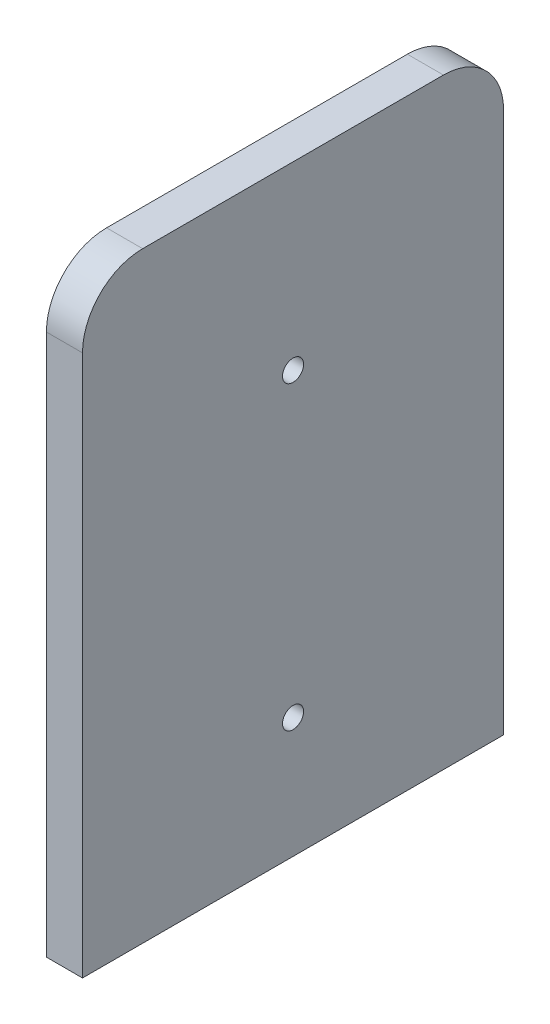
from build123d import *

# Parameters (mm, degrees)
SKETCH1_W                   = 70
SKETCH1_H                   = 100
EXTRUDE1_DEPTH              = 6
M3_TAPPED_HOLE1_D           = 2.5
M3_TAPPED_HOLE1_DEPTH       = 10
M3_TAPPED_HOLE1_CBORE_D     = 3
M3_TAPPED_HOLE1_CBORE_DEPTH = 6
M3_TAPPED_HOLE1_TIP         = 0.751075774
SKETCH4_R                   = 1.75
EXTRUDE2_DEPTH              = 123.21292894
FILLET1_R                   = 10


with BuildPart() as part:
    # Sketch1 → Extrude1 (new body)
    with BuildSketch(Plane(origin=(0, 0, 0), x_dir=(0, 0, -1), z_dir=(1, 0, 0))):
        with Locations((35, 50)):
            Rectangle(SKETCH1_W, SKETCH1_H)
    extrude(amount=EXTRUDE1_DEPTH)

    # M3 Tapped Hole1
    with Locations(Plane(origin=(3, 0, -20), x_dir=(0, 0, -1), z_dir=(0, -1, 0))):
        with Locations((0, 0), (30, 0)):
            CounterBoreHole(M3_TAPPED_HOLE1_D / 2, M3_TAPPED_HOLE1_CBORE_D / 2, M3_TAPPED_HOLE1_CBORE_DEPTH, depth=M3_TAPPED_HOLE1_DEPTH)
            with Locations((0, 0, -(M3_TAPPED_HOLE1_DEPTH + M3_TAPPED_HOLE1_TIP / 2))):  # 118° drill point
                Cone(0, M3_TAPPED_HOLE1_D / 2, M3_TAPPED_HOLE1_TIP, mode=Mode.SUBTRACT)

    # Sketch4 → Extrude2 (cut, through all)
    with BuildSketch(Plane(origin=(6, 0, 0), x_dir=(0, 0, -1), z_dir=(1, 0, 0))):
        with Locations((35, 70)):
            Circle(SKETCH4_R)
        with Locations((35, 20)):
            Circle(SKETCH4_R)
    extrude(amount=-EXTRUDE2_DEPTH, mode=Mode.SUBTRACT)

    # Fillet1
    fillet1_edges = [part.edges().sort_by_distance(p)[0] for p in [
        (3, 100, 0),
        (3, 100, -70),
    ]]
    fillet(fillet1_edges, radius=FILLET1_R)


solid = part.part
